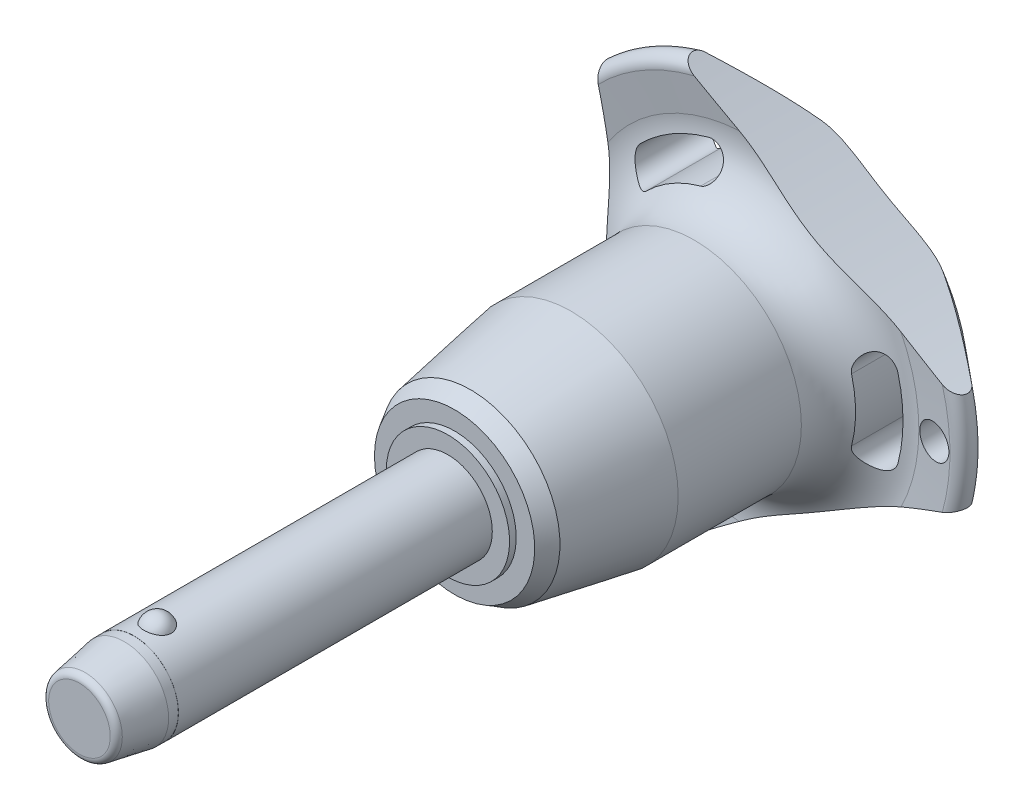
from build123d import *

# Parameters (mm, degrees)
SKETCH1_R           = 4
BOSS_EXTRUDE1_DEPTH = 25
SKETCH2_R           = 3.4
BOSS_EXTRUDE2_DEPTH = 33.3
BOSS_EXTRUDE3_START = 8.2
SKETCH1_2_R         = 4
BOSS_EXTRUDE3_DEPTH = 8.2
CHAMFER1_SIZE       = 4.1
CHAMFER1_SIZE2      = 0.722940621
FILLET1_R           = 0.6
SKETCH6_R           = 102.8
CUT_EXTRUDE1_DEPTH  = 65.557185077
CIRPATTERN1_COUNT   = 3
SKETCH7_R           = 1.5
CUT_EXTRUDE2_DEPTH  = 65.306162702
SKETCH8_R           = 4
SKETCH8_R_2         = 3.99
CUT_EXTRUDE3_DEPTH  = 4.92


with BuildPart() as part:
    # Sketch1 → Boss-Extrude1 (new body)
    with BuildSketch(Plane.XY):
        Circle(SKETCH1_R)
    extrude(amount=-BOSS_EXTRUDE1_DEPTH)

    # Sketch2 → Boss-Extrude2 (add)
    with BuildSketch(Plane(origin=(0, 0, -25), x_dir=(-1, 0, 0), z_dir=(0, 0, -1))):
        Circle(SKETCH2_R)
    extrude(amount=BOSS_EXTRUDE2_DEPTH)

    # Sketch3 → Revolve1 (revolve)
    with BuildSketch(Plane(origin=(0, 0, 0), x_dir=(0, 0, -1), z_dir=(1, 0, 0))):
        with BuildLine():
            Line((-1.2, 4.8), (-1.2, 2.2))
            ThreePointArc((-1.2, 2.2), (0.1, 3.5), (-1.2, 4.8))
        make_face()
        with BuildLine():
            Line((-1.2, -2.2), (-1.2, -4.8))
            ThreePointArc((-1.2, -4.8), (0.1, -3.5), (-1.2, -2.2))
        make_face()
    revolve(axis=Axis((0, -2.2, 1.2), (0, 1, 0)))

    # Sketch1_2 → Boss-Extrude3 (add)
    with BuildSketch(Plane.XY.offset(BOSS_EXTRUDE3_START)):
        Circle(SKETCH1_2_R)
    extrude(amount=-BOSS_EXTRUDE3_DEPTH)

    # Chamfer1
    chamfer1_edges = [part.edges().sort_by_distance(p)[0] for p in [
        (-4, 0, 8.2),
    ]]
    chamfer1_side = [part.faces().sort_by_distance(p)[0] for p in [
        (-4, 0, -8.4),
    ]]
    chamfer(chamfer1_edges, length=CHAMFER1_SIZE, length2=CHAMFER1_SIZE2, reference=chamfer1_side[0])

    # Fillet1
    fillet1_edges = [part.edges().sort_by_distance(p)[0] for p in [
        (-3.277059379, 0, 8.2),
        (3.4, 0, -58.3),
    ]]
    fillet(fillet1_edges, radius=FILLET1_R)

    # Sketch4 → Revolve2 (revolve)
    with BuildSketch(Plane(origin=(0, 0, 0), x_dir=(0, 0, -1), z_dir=(1, 0, 0)), mode=Mode.PRIVATE) as revolve2_sk:
        Polygon((25, 0), (25, 5.554101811), (25.6, 5.554101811), (25.6, 7.220004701), (27.042714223, 8.052956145), (36.1, 9.65), (47.2, 9.65), (47.2, 0), align=None)
    revolve(revolve2_sk.sketch.rotate(Axis((0, 0, -47.2), (0, 0, 1)), 90), axis=Axis((0, 0, -47.2), (0, 0, 1)))

    # Sketch5 → Revolve3 (revolve)
    with BuildSketch(Plane(origin=(0, 0, 0), x_dir=(0, 0, -1), z_dir=(1, 0, 0)), mode=Mode.PRIVATE) as revolve3_sk:
        with BuildLine():
            Line((52.16082631, 15.274661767), (51.757834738, 18.475067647))
            ThreePointArc((51.757834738, 18.475067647), (52.349836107, 19.516443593), (53.516044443, 19.24278761))
            Line((53.516044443, 19.24278761), (57.835691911, 14.094832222))
            ThreePointArc((57.835691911, 14.094832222), (58.3, 12.689260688), (57.67067517, 11.349423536))
            ThreePointArc((57.67067517, 11.349423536), (54.033110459, 6.185112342), (52.75, 0))
            Line((52.75, 0), (47.2, 0))
            Line((47.2, 0), (47.2, 9.65))
            ThreePointArc((47.2, 9.65), (50.949887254, 11.342683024), (52.16082631, 15.274661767))
        make_face()
    revolve(revolve3_sk.sketch.rotate(Axis((0, 0, -52.75), (0, 0, 1)), 90), axis=Axis((0, 0, -52.75), (0, 0, 1)))

    # Sketch6 → Cut-Extrude1 (cut, through all)
    with BuildSketch(Plane.XY):
        with Locations((-115.2, 0)):
            Circle(SKETCH6_R)
        with BuildLine():
            ThreePointArc((13.411913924, -3.529271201), (13.868496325, 0), (13.411913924, 3.529271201))
            ThreePointArc((13.411913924, 3.529271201), (11.694200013, 4.531299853), (10.692171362, 2.813585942))
            ThreePointArc((10.692171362, 2.813585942), (11.056165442, 0), (10.692171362, -2.813585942))
            ThreePointArc((10.692171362, -2.813585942), (11.694200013, -4.531299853), (13.411913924, -3.529271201))
        make_face()
    cut_extrude1 = extrude(amount=-CUT_EXTRUDE1_DEPTH, mode=Mode.SUBTRACT)

    # CirPattern1: Cut-Extrude1 ×3 about axis
    cirpattern1_axis = Axis((0, 0, 0), (0, 0, 1))
    for i in range(1, CIRPATTERN1_COUNT):
        add(cut_extrude1.rotate(cirpattern1_axis, i * 360 / CIRPATTERN1_COUNT), mode=Mode.SUBTRACT)

    # Sketch7 → Cut-Extrude2 (cut, through all)
    with BuildSketch(Plane.XY):
        with Locations(Location((16.868496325, 0, 0), (0, 0, 225.467095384))):
            Circle(SKETCH7_R)
    extrude(amount=-CUT_EXTRUDE2_DEPTH, mode=Mode.SUBTRACT)

    # Sketch8 → Cut-Extrude3 (cut)
    with BuildSketch(Plane.XY.offset(8.2)):
        Circle(SKETCH8_R)
        Circle(SKETCH8_R_2, mode=Mode.SUBTRACT)
    extrude(amount=-CUT_EXTRUDE3_DEPTH, mode=Mode.SUBTRACT)


solid = part.part
